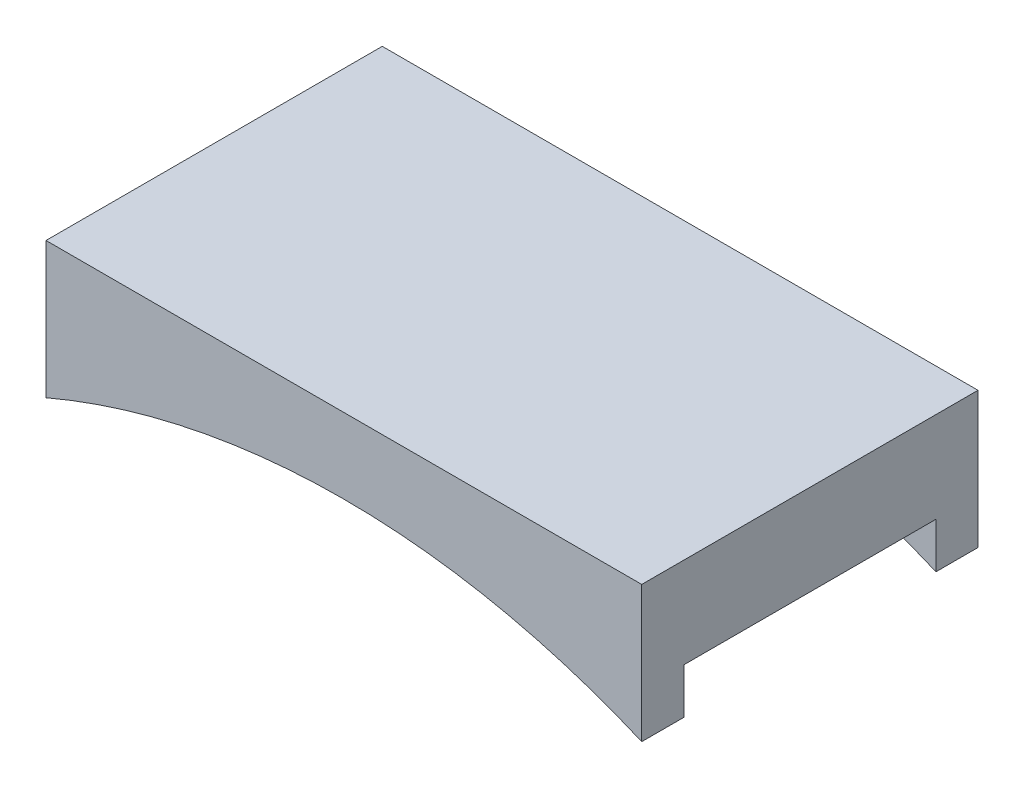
ISO-10303-21;
HEADER;
FILE_DESCRIPTION(('STEP AP214'),'2;1');
FILE_NAME('part.step','',(''),(''),'','','');
FILE_SCHEMA(('AUTOMOTIVE_DESIGN { 1 0 10303 214 1 1 1 1 }'));
ENDSEC;
DATA;
#1=APPLICATION_CONTEXT('core data for automotive mechanical design processes');
#2=APPLICATION_PROTOCOL_DEFINITION('international standard','automotive_design',2000,#1);
#3=PRODUCT_CONTEXT('',#1,'mechanical');
#4=PRODUCT('Part','Part','',(#3));
#5=PRODUCT_RELATED_PRODUCT_CATEGORY('part','',(#4));
#6=PRODUCT_DEFINITION_FORMATION('','',#4);
#7=PRODUCT_DEFINITION_CONTEXT('part definition',#1,'design');
#8=PRODUCT_DEFINITION('design','',#6,#7);
#9=PRODUCT_DEFINITION_SHAPE('','',#8);
#10=(LENGTH_UNIT() NAMED_UNIT(*) SI_UNIT(.MILLI.,.METRE.));
#11=(NAMED_UNIT(*) PLANE_ANGLE_UNIT() SI_UNIT($,.RADIAN.));
#12=(NAMED_UNIT(*) SI_UNIT($,.STERADIAN.) SOLID_ANGLE_UNIT());
#13=UNCERTAINTY_MEASURE_WITH_UNIT(LENGTH_MEASURE(1.E-05),#10,'distance_accuracy_value','');
#14=(GEOMETRIC_REPRESENTATION_CONTEXT(3) GLOBAL_UNCERTAINTY_ASSIGNED_CONTEXT((#13)) GLOBAL_UNIT_ASSIGNED_CONTEXT((#10,
#11,#12)) REPRESENTATION_CONTEXT('',''));
#15=CARTESIAN_POINT('',(0.,0.,0.));
#16=DIRECTION('',(0.,0.,1.));
#17=DIRECTION('',(1.,0.,0.));
#18=AXIS2_PLACEMENT_3D('',#15,#16,#17);
#19=CARTESIAN_POINT('',(0.,0.,12.7));
#20=DIRECTION('',(1.,0.,0.));
#21=DIRECTION('',(0.,1.,0.));
#22=AXIS2_PLACEMENT_3D('',#19,#20,#21);
#23=PLANE('',#22);
#24=DIRECTION('',(0.,0.,1.));
#25=VECTOR('',#24,1.);
#26=CARTESIAN_POINT('',(0.,-10.2874295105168,9.525));
#27=LINE('',#26,#25);
#28=CARTESIAN_POINT('',(0.,-10.2874295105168,9.525));
#29=VERTEX_POINT('',#28);
#30=CARTESIAN_POINT('',(0.,-10.2874295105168,12.7));
#31=VERTEX_POINT('',#30);
#32=EDGE_CURVE('E158',#29,#31,#27,.T.);
#33=ORIENTED_EDGE('',*,*,#32,.T.);
#34=DIRECTION('',(0.,-1.,0.));
#35=VECTOR('',#34,1.);
#36=CARTESIAN_POINT('',(0.,0.,12.7));
#37=LINE('',#36,#35);
#38=CARTESIAN_POINT('',(0.,0.,12.7));
#39=VERTEX_POINT('',#38);
#40=EDGE_CURVE('E170',#39,#31,#37,.T.);
#41=ORIENTED_EDGE('',*,*,#40,.F.);
#42=DIRECTION('',(0.,0.,-1.));
#43=VECTOR('',#42,1.);
#44=CARTESIAN_POINT('',(0.,0.,12.7));
#45=LINE('',#44,#43);
#46=CARTESIAN_POINT('',(0.,0.,-12.7));
#47=VERTEX_POINT('',#46);
#48=EDGE_CURVE('E180',#39,#47,#45,.T.);
#49=ORIENTED_EDGE('',*,*,#48,.T.);
#50=DIRECTION('',(0.,-1.,0.));
#51=VECTOR('',#50,1.);
#52=CARTESIAN_POINT('',(0.,0.,-12.7));
#53=LINE('',#52,#51);
#54=CARTESIAN_POINT('',(0.,-10.2874295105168,-12.7));
#55=VERTEX_POINT('',#54);
#56=EDGE_CURVE('E166',#47,#55,#53,.T.);
#57=ORIENTED_EDGE('',*,*,#56,.T.);
#58=DIRECTION('',(0.,0.,-1.));
#59=VECTOR('',#58,1.);
#60=CARTESIAN_POINT('',(0.,-10.2874295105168,-9.525));
#61=LINE('',#60,#59);
#62=CARTESIAN_POINT('',(0.,-10.2874295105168,-9.525));
#63=VERTEX_POINT('',#62);
#64=EDGE_CURVE('E128',#63,#55,#61,.T.);
#65=ORIENTED_EDGE('',*,*,#64,.F.);
#66=DIRECTION('',(0.,-1.,0.));
#67=VECTOR('',#66,1.);
#68=CARTESIAN_POINT('',(0.,-10.2874295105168,-9.525));
#69=LINE('',#68,#67);
#70=CARTESIAN_POINT('',(0.,-6.85,-9.525));
#71=VERTEX_POINT('',#70);
#72=EDGE_CURVE('E114',#71,#63,#69,.T.);
#73=ORIENTED_EDGE('',*,*,#72,.F.);
#74=DIRECTION('',(0.,0.,-1.));
#75=VECTOR('',#74,1.);
#76=CARTESIAN_POINT('',(0.,-6.85,12.7));
#77=LINE('',#76,#75);
#78=CARTESIAN_POINT('',(0.,-6.85,9.525));
#79=VERTEX_POINT('',#78);
#80=EDGE_CURVE('E11',#79,#71,#77,.T.);
#81=ORIENTED_EDGE('',*,*,#80,.F.);
#82=DIRECTION('',(0.,-1.,0.));
#83=VECTOR('',#82,1.);
#84=CARTESIAN_POINT('',(0.,-10.2874295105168,9.525));
#85=LINE('',#84,#83);
#86=EDGE_CURVE('E147',#79,#29,#85,.T.);
#87=ORIENTED_EDGE('',*,*,#86,.T.);
#88=EDGE_LOOP('',(#33,#41,#49,#57,#65,#73,#81,#87));
#89=FACE_BOUND('',#88,.T.);
#90=ADVANCED_FACE('F45',(#89),#23,.F.);
#91=CARTESIAN_POINT('',(22.5,-62.8219181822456,12.7));
#92=DIRECTION('',(0.,0.,-1.));
#93=DIRECTION('',(-1.,0.,0.));
#94=AXIS2_PLACEMENT_3D('',#91,#92,#93);
#95=CYLINDRICAL_SURFACE('',#94,60.325);
#96=ORIENTED_EDGE('',*,*,#80,.T.);
#97=CARTESIAN_POINT('',(22.5,-62.8219181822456,-9.525));
#98=DIRECTION('',(0.,0.,1.));
#99=DIRECTION('',(-1.,0.,0.));
#100=AXIS2_PLACEMENT_3D('',#97,#98,#99);
#101=CIRCLE('',#100,60.325);
#102=CARTESIAN_POINT('',(45.,-6.84999999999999,-9.525));
#103=VERTEX_POINT('',#102);
#104=EDGE_CURVE('E63',#103,#71,#101,.T.);
#105=ORIENTED_EDGE('',*,*,#104,.F.);
#106=DIRECTION('',(0.,0.,-1.));
#107=VECTOR('',#106,1.);
#108=CARTESIAN_POINT('',(45.,-6.84999999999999,12.7));
#109=LINE('',#108,#107);
#110=CARTESIAN_POINT('',(45.,-6.84999999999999,9.525));
#111=VERTEX_POINT('',#110);
#112=EDGE_CURVE('E53',#111,#103,#109,.T.);
#113=ORIENTED_EDGE('',*,*,#112,.F.);
#114=CARTESIAN_POINT('',(22.5,-62.8219181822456,9.525));
#115=DIRECTION('',(0.,0.,1.));
#116=DIRECTION('',(-1.,0.,0.));
#117=AXIS2_PLACEMENT_3D('',#114,#115,#116);
#118=CIRCLE('',#117,60.325);
#119=EDGE_CURVE('E144',#111,#79,#118,.T.);
#120=ORIENTED_EDGE('',*,*,#119,.T.);
#121=EDGE_LOOP('',(#96,#105,#113,#120));
#122=FACE_BOUND('',#121,.T.);
#123=ADVANCED_FACE('F215',(#122),#95,.F.);
#124=CARTESIAN_POINT('',(45.,0.,12.7));
#125=DIRECTION('',(-1.,0.,0.));
#126=DIRECTION('',(0.,0.,1.));
#127=AXIS2_PLACEMENT_3D('',#124,#125,#126);
#128=PLANE('',#127);
#129=DIRECTION('',(0.,1.,0.));
#130=VECTOR('',#129,1.);
#131=CARTESIAN_POINT('',(45.,-10.2874295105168,9.525));
#132=LINE('',#131,#130);
#133=CARTESIAN_POINT('',(45.,-10.2874295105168,9.525));
#134=VERTEX_POINT('',#133);
#135=EDGE_CURVE('E155',#134,#111,#132,.T.);
#136=ORIENTED_EDGE('',*,*,#135,.T.);
#137=ORIENTED_EDGE('',*,*,#112,.T.);
#138=DIRECTION('',(0.,1.,0.));
#139=VECTOR('',#138,1.);
#140=CARTESIAN_POINT('',(45.,-10.2874295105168,-9.525));
#141=LINE('',#140,#139);
#142=CARTESIAN_POINT('',(45.,-10.2874295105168,-9.525));
#143=VERTEX_POINT('',#142);
#144=EDGE_CURVE('E113',#143,#103,#141,.T.);
#145=ORIENTED_EDGE('',*,*,#144,.F.);
#146=DIRECTION('',(0.,0.,-1.));
#147=VECTOR('',#146,1.);
#148=CARTESIAN_POINT('',(45.,-10.2874295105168,-9.525));
#149=LINE('',#148,#147);
#150=CARTESIAN_POINT('',(45.,-10.2874295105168,-12.7));
#151=VERTEX_POINT('',#150);
#152=EDGE_CURVE('E122',#143,#151,#149,.T.);
#153=ORIENTED_EDGE('',*,*,#152,.T.);
#154=DIRECTION('',(0.,1.,0.));
#155=VECTOR('',#154,1.);
#156=CARTESIAN_POINT('',(45.,0.,-12.7));
#157=LINE('',#156,#155);
#158=CARTESIAN_POINT('',(45.,0.,-12.7));
#159=VERTEX_POINT('',#158);
#160=EDGE_CURVE('E183',#151,#159,#157,.T.);
#161=ORIENTED_EDGE('',*,*,#160,.T.);
#162=DIRECTION('',(0.,0.,-1.));
#163=VECTOR('',#162,1.);
#164=CARTESIAN_POINT('',(45.,0.,12.7));
#165=LINE('',#164,#163);
#166=CARTESIAN_POINT('',(45.,0.,12.7));
#167=VERTEX_POINT('',#166);
#168=EDGE_CURVE('E191',#167,#159,#165,.T.);
#169=ORIENTED_EDGE('',*,*,#168,.F.);
#170=DIRECTION('',(0.,1.,0.));
#171=VECTOR('',#170,1.);
#172=CARTESIAN_POINT('',(45.,0.,12.7));
#173=LINE('',#172,#171);
#174=CARTESIAN_POINT('',(45.,-10.2874295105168,12.7));
#175=VERTEX_POINT('',#174);
#176=EDGE_CURVE('E173',#175,#167,#173,.T.);
#177=ORIENTED_EDGE('',*,*,#176,.F.);
#178=DIRECTION('',(0.,0.,1.));
#179=VECTOR('',#178,1.);
#180=CARTESIAN_POINT('',(45.,-10.2874295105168,9.525));
#181=LINE('',#180,#179);
#182=EDGE_CURVE('E162',#134,#175,#181,.T.);
#183=ORIENTED_EDGE('',*,*,#182,.F.);
#184=EDGE_LOOP('',(#136,#137,#145,#153,#161,#169,#177,#183));
#185=FACE_BOUND('',#184,.T.);
#186=ADVANCED_FACE('F131',(#185),#128,.F.);
#187=CARTESIAN_POINT('',(0.,0.,12.7));
#188=DIRECTION('',(0.,-1.,0.));
#189=DIRECTION('',(0.,0.,-1.));
#190=AXIS2_PLACEMENT_3D('',#187,#188,#189);
#191=PLANE('',#190);
#192=DIRECTION('',(-1.,0.,0.));
#193=VECTOR('',#192,1.);
#194=CARTESIAN_POINT('',(0.,0.,-12.7));
#195=LINE('',#194,#193);
#196=EDGE_CURVE('E174',#159,#47,#195,.T.);
#197=ORIENTED_EDGE('',*,*,#196,.T.);
#198=ORIENTED_EDGE('',*,*,#48,.F.);
#199=DIRECTION('',(-1.,0.,0.));
#200=VECTOR('',#199,1.);
#201=CARTESIAN_POINT('',(0.,0.,12.7));
#202=LINE('',#201,#200);
#203=EDGE_CURVE('E177',#167,#39,#202,.T.);
#204=ORIENTED_EDGE('',*,*,#203,.F.);
#205=ORIENTED_EDGE('',*,*,#168,.T.);
#206=EDGE_LOOP('',(#197,#198,#204,#205));
#207=FACE_BOUND('',#206,.T.);
#208=ADVANCED_FACE('F199',(#207),#191,.F.);
#209=CARTESIAN_POINT('',(22.5,-62.8219181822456,12.7));
#210=DIRECTION('',(0.,0.,1.));
#211=DIRECTION('',(1.,0.,0.));
#212=AXIS2_PLACEMENT_3D('',#209,#210,#211);
#213=PLANE('',#212);
#214=ORIENTED_EDGE('',*,*,#40,.T.);
#215=CARTESIAN_POINT('',(22.5,-62.8219181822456,12.7));
#216=DIRECTION('',(0.,0.,-1.));
#217=DIRECTION('',(-1.,0.,0.));
#218=AXIS2_PLACEMENT_3D('',#215,#216,#217);
#219=CIRCLE('',#218,57.15);
#220=EDGE_CURVE('E142',#31,#175,#219,.T.);
#221=ORIENTED_EDGE('',*,*,#220,.T.);
#222=ORIENTED_EDGE('',*,*,#176,.T.);
#223=ORIENTED_EDGE('',*,*,#203,.T.);
#224=EDGE_LOOP('',(#214,#221,#222,#223));
#225=FACE_BOUND('',#224,.T.);
#226=ADVANCED_FACE('F208',(#225),#213,.T.);
#227=CARTESIAN_POINT('',(22.5,-62.8219181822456,-12.7));
#228=DIRECTION('',(0.,0.,1.));
#229=DIRECTION('',(1.,0.,0.));
#230=AXIS2_PLACEMENT_3D('',#227,#228,#229);
#231=PLANE('',#230);
#232=ORIENTED_EDGE('',*,*,#56,.F.);
#233=ORIENTED_EDGE('',*,*,#196,.F.);
#234=ORIENTED_EDGE('',*,*,#160,.F.);
#235=CARTESIAN_POINT('',(22.5,-62.8219181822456,-12.7));
#236=DIRECTION('',(0.,0.,-1.));
#237=DIRECTION('',(-1.,0.,0.));
#238=AXIS2_PLACEMENT_3D('',#235,#236,#237);
#239=CIRCLE('',#238,57.15);
#240=EDGE_CURVE('E125',#55,#151,#239,.T.);
#241=ORIENTED_EDGE('',*,*,#240,.F.);
#242=EDGE_LOOP('',(#232,#233,#234,#241));
#243=FACE_BOUND('',#242,.T.);
#244=ADVANCED_FACE('F203',(#243),#231,.F.);
#245=CARTESIAN_POINT('',(22.5,-62.8219181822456,9.525));
#246=DIRECTION('',(0.,0.,1.));
#247=DIRECTION('',(1.,0.,0.));
#248=AXIS2_PLACEMENT_3D('',#245,#246,#247);
#249=CYLINDRICAL_SURFACE('',#248,57.15);
#250=ORIENTED_EDGE('',*,*,#220,.F.);
#251=ORIENTED_EDGE('',*,*,#32,.F.);
#252=CARTESIAN_POINT('',(22.5,-62.8219181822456,9.525));
#253=DIRECTION('',(0.,0.,-1.));
#254=DIRECTION('',(-1.,0.,0.));
#255=AXIS2_PLACEMENT_3D('',#252,#253,#254);
#256=CIRCLE('',#255,57.15);
#257=EDGE_CURVE('E151',#29,#134,#256,.T.);
#258=ORIENTED_EDGE('',*,*,#257,.T.);
#259=ORIENTED_EDGE('',*,*,#182,.T.);
#260=EDGE_LOOP('',(#250,#251,#258,#259));
#261=FACE_BOUND('',#260,.T.);
#262=ADVANCED_FACE('F210',(#261),#249,.F.);
#263=CARTESIAN_POINT('',(22.5,-62.8219181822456,9.525));
#264=DIRECTION('',(0.,0.,-1.));
#265=DIRECTION('',(-1.,0.,0.));
#266=AXIS2_PLACEMENT_3D('',#263,#264,#265);
#267=PLANE('',#266);
#268=ORIENTED_EDGE('',*,*,#119,.F.);
#269=ORIENTED_EDGE('',*,*,#135,.F.);
#270=ORIENTED_EDGE('',*,*,#257,.F.);
#271=ORIENTED_EDGE('',*,*,#86,.F.);
#272=EDGE_LOOP('',(#268,#269,#270,#271));
#273=FACE_BOUND('',#272,.T.);
#274=ADVANCED_FACE('F214',(#273),#267,.T.);
#275=CARTESIAN_POINT('',(22.5,-62.8219181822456,-9.525));
#276=DIRECTION('',(0.,0.,-1.));
#277=DIRECTION('',(-1.,0.,0.));
#278=AXIS2_PLACEMENT_3D('',#275,#276,#277);
#279=CYLINDRICAL_SURFACE('',#278,57.15);
#280=ORIENTED_EDGE('',*,*,#240,.T.);
#281=ORIENTED_EDGE('',*,*,#152,.F.);
#282=CARTESIAN_POINT('',(22.5,-62.8219181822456,-9.525));
#283=DIRECTION('',(0.,0.,-1.));
#284=DIRECTION('',(-1.,0.,0.));
#285=AXIS2_PLACEMENT_3D('',#282,#283,#284);
#286=CIRCLE('',#285,57.15);
#287=EDGE_CURVE('E109',#63,#143,#286,.T.);
#288=ORIENTED_EDGE('',*,*,#287,.F.);
#289=ORIENTED_EDGE('',*,*,#64,.T.);
#290=EDGE_LOOP('',(#280,#281,#288,#289));
#291=FACE_BOUND('',#290,.T.);
#292=ADVANCED_FACE('F123',(#291),#279,.F.);
#293=CARTESIAN_POINT('',(22.5,-62.8219181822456,-9.525));
#294=DIRECTION('',(0.,0.,1.));
#295=DIRECTION('',(-1.,0.,0.));
#296=AXIS2_PLACEMENT_3D('',#293,#294,#295);
#297=PLANE('',#296);
#298=ORIENTED_EDGE('',*,*,#104,.T.);
#299=ORIENTED_EDGE('',*,*,#72,.T.);
#300=ORIENTED_EDGE('',*,*,#287,.T.);
#301=ORIENTED_EDGE('',*,*,#144,.T.);
#302=EDGE_LOOP('',(#298,#299,#300,#301));
#303=FACE_BOUND('',#302,.T.);
#304=ADVANCED_FACE('F111',(#303),#297,.T.);
#305=CLOSED_SHELL('',(#90,#123,#186,#208,#226,#244,#262,#274,#292,#304));
#306=MANIFOLD_SOLID_BREP('B2',#305);
#307=ADVANCED_BREP_SHAPE_REPRESENTATION('',(#18,#306),#14);
#308=SHAPE_DEFINITION_REPRESENTATION(#9,#307);
ENDSEC;
END-ISO-10303-21;
